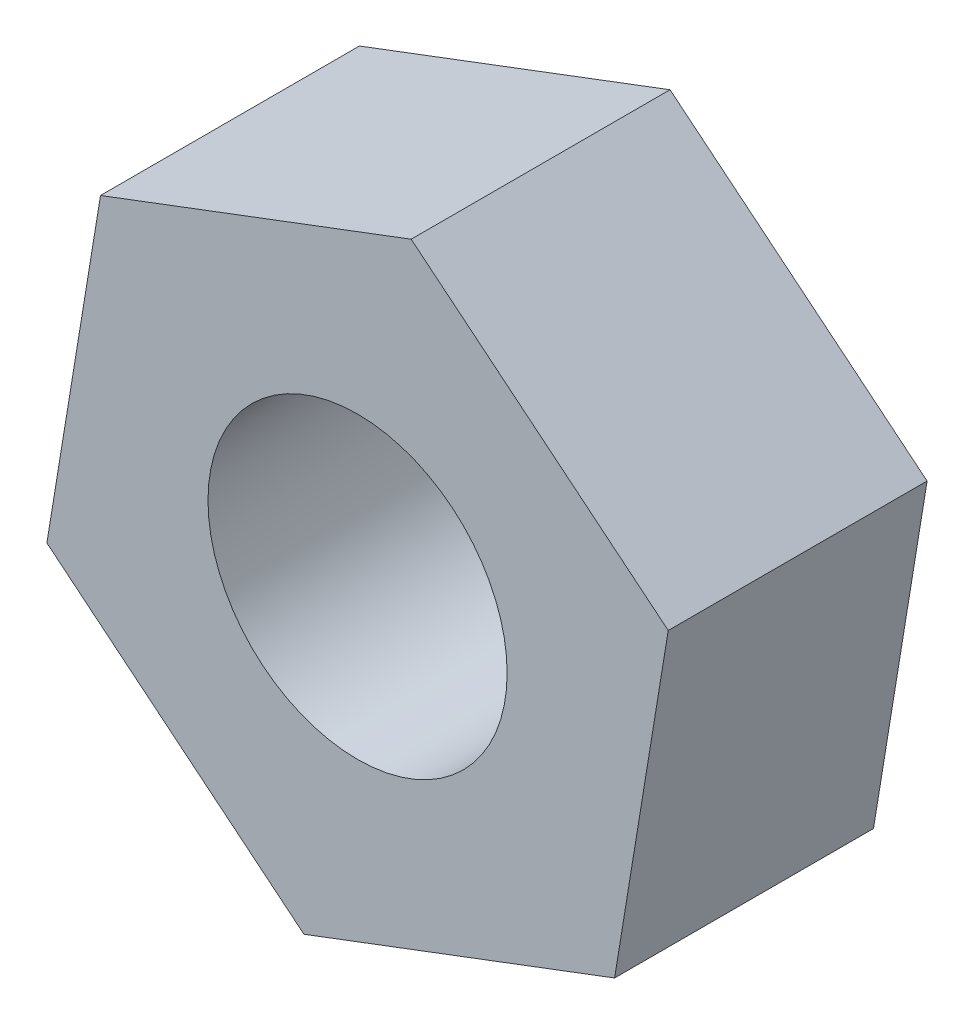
ISO-10303-21;
HEADER;
FILE_DESCRIPTION(('STEP AP214'),'2;1');
FILE_NAME('part.step','',(''),(''),'','','');
FILE_SCHEMA(('AUTOMOTIVE_DESIGN { 1 0 10303 214 1 1 1 1 }'));
ENDSEC;
DATA;
#1=APPLICATION_CONTEXT('core data for automotive mechanical design processes');
#2=APPLICATION_PROTOCOL_DEFINITION('international standard','automotive_design',2000,#1);
#3=PRODUCT_CONTEXT('',#1,'mechanical');
#4=PRODUCT('Part','Part','',(#3));
#5=PRODUCT_RELATED_PRODUCT_CATEGORY('part','',(#4));
#6=PRODUCT_DEFINITION_FORMATION('','',#4);
#7=PRODUCT_DEFINITION_CONTEXT('part definition',#1,'design');
#8=PRODUCT_DEFINITION('design','',#6,#7);
#9=PRODUCT_DEFINITION_SHAPE('','',#8);
#10=(LENGTH_UNIT() NAMED_UNIT(*) SI_UNIT(.MILLI.,.METRE.));
#11=(NAMED_UNIT(*) PLANE_ANGLE_UNIT() SI_UNIT($,.RADIAN.));
#12=(NAMED_UNIT(*) SI_UNIT($,.STERADIAN.) SOLID_ANGLE_UNIT());
#13=UNCERTAINTY_MEASURE_WITH_UNIT(LENGTH_MEASURE(1.E-05),#10,'distance_accuracy_value','');
#14=(GEOMETRIC_REPRESENTATION_CONTEXT(3) GLOBAL_UNCERTAINTY_ASSIGNED_CONTEXT((#13)) GLOBAL_UNIT_ASSIGNED_CONTEXT((#10,
#11,#12)) REPRESENTATION_CONTEXT('',''));
#15=CARTESIAN_POINT('',(0.,0.,0.));
#16=DIRECTION('',(0.,0.,1.));
#17=DIRECTION('',(1.,0.,0.));
#18=AXIS2_PLACEMENT_3D('',#15,#16,#17);
#19=CARTESIAN_POINT('',(-0.931966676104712,-5.69778653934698,4.5));
#20=DIRECTION('',(-0.353647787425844,0.93537866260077,0.));
#21=DIRECTION('',(-0.93537866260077,-0.353647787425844,0.));
#22=AXIS2_PLACEMENT_3D('',#19,#20,#21);
#23=PLANE('',#22);
#24=DIRECTION('',(0.93537866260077,0.353647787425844,0.));
#25=VECTOR('',#24,1.);
#26=CARTESIAN_POINT('',(-0.931966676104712,-5.69778653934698,0.));
#27=LINE('',#26,#25);
#28=CARTESIAN_POINT('',(-0.931966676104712,-5.69778653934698,0.));
#29=VERTEX_POINT('',#28);
#30=CARTESIAN_POINT('',(4.46844455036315,-3.65600008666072,0.));
#31=VERTEX_POINT('',#30);
#32=EDGE_CURVE('E118',#29,#31,#27,.T.);
#33=ORIENTED_EDGE('',*,*,#32,.T.);
#34=DIRECTION('',(0.,0.,-1.));
#35=VECTOR('',#34,1.);
#36=CARTESIAN_POINT('',(4.46844455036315,-3.65600008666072,4.5));
#37=LINE('',#36,#35);
#38=CARTESIAN_POINT('',(4.46844455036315,-3.65600008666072,4.5));
#39=VERTEX_POINT('',#38);
#40=EDGE_CURVE('E11',#39,#31,#37,.T.);
#41=ORIENTED_EDGE('',*,*,#40,.F.);
#42=DIRECTION('',(0.93537866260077,0.353647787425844,0.));
#43=VECTOR('',#42,1.);
#44=CARTESIAN_POINT('',(-0.931966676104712,-5.69778653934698,4.5));
#45=LINE('',#44,#43);
#46=CARTESIAN_POINT('',(-0.931966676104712,-5.69778653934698,4.5));
#47=VERTEX_POINT('',#46);
#48=EDGE_CURVE('E129',#47,#39,#45,.T.);
#49=ORIENTED_EDGE('',*,*,#48,.F.);
#50=DIRECTION('',(0.,0.,-1.));
#51=VECTOR('',#50,1.);
#52=CARTESIAN_POINT('',(-0.931966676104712,-5.69778653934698,4.5));
#53=LINE('',#52,#51);
#54=EDGE_CURVE('E114',#47,#29,#53,.T.);
#55=ORIENTED_EDGE('',*,*,#54,.T.);
#56=EDGE_LOOP('',(#33,#41,#49,#55));
#57=FACE_BOUND('',#56,.T.);
#58=ADVANCED_FACE('F34',(#57),#23,.F.);
#59=CARTESIAN_POINT('',(4.46844455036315,-3.65600008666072,4.5));
#60=DIRECTION('',(-0.986885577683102,0.161421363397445,0.));
#61=DIRECTION('',(-0.161421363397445,-0.986885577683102,0.));
#62=AXIS2_PLACEMENT_3D('',#59,#60,#61);
#63=PLANE('',#62);
#64=DIRECTION('',(0.161421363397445,0.986885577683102,0.));
#65=VECTOR('',#64,1.);
#66=CARTESIAN_POINT('',(4.46844455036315,-3.65600008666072,0.));
#67=LINE('',#66,#65);
#68=CARTESIAN_POINT('',(5.40041122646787,2.04178645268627,0.));
#69=VERTEX_POINT('',#68);
#70=EDGE_CURVE('E121',#31,#69,#67,.T.);
#71=ORIENTED_EDGE('',*,*,#70,.T.);
#72=DIRECTION('',(0.,0.,-1.));
#73=VECTOR('',#72,1.);
#74=CARTESIAN_POINT('',(5.40041122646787,2.04178645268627,4.5));
#75=LINE('',#74,#73);
#76=CARTESIAN_POINT('',(5.40041122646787,2.04178645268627,4.5));
#77=VERTEX_POINT('',#76);
#78=EDGE_CURVE('E42',#77,#69,#75,.T.);
#79=ORIENTED_EDGE('',*,*,#78,.F.);
#80=DIRECTION('',(0.161421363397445,0.986885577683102,0.));
#81=VECTOR('',#80,1.);
#82=CARTESIAN_POINT('',(4.46844455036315,-3.65600008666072,4.5));
#83=LINE('',#82,#81);
#84=EDGE_CURVE('E87',#39,#77,#83,.T.);
#85=ORIENTED_EDGE('',*,*,#84,.F.);
#86=ORIENTED_EDGE('',*,*,#40,.T.);
#87=EDGE_LOOP('',(#71,#79,#85,#86));
#88=FACE_BOUND('',#87,.T.);
#89=ADVANCED_FACE('F154',(#88),#63,.F.);
#90=CARTESIAN_POINT('',(5.40041122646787,2.04178645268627,4.5));
#91=DIRECTION('',(-0.633237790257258,-0.773957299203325,0.));
#92=DIRECTION('',(0.773957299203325,-0.633237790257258,0.));
#93=AXIS2_PLACEMENT_3D('',#90,#91,#92);
#94=PLANE('',#93);
#95=DIRECTION('',(-0.773957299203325,0.633237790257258,0.));
#96=VECTOR('',#95,1.);
#97=CARTESIAN_POINT('',(5.40041122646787,2.04178645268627,0.));
#98=LINE('',#97,#96);
#99=CARTESIAN_POINT('',(0.931966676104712,5.69778653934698,0.));
#100=VERTEX_POINT('',#99);
#101=EDGE_CURVE('E124',#69,#100,#98,.T.);
#102=ORIENTED_EDGE('',*,*,#101,.T.);
#103=DIRECTION('',(0.,0.,-1.));
#104=VECTOR('',#103,1.);
#105=CARTESIAN_POINT('',(0.931966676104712,5.69778653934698,4.5));
#106=LINE('',#105,#104);
#107=CARTESIAN_POINT('',(0.931966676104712,5.69778653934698,4.5));
#108=VERTEX_POINT('',#107);
#109=EDGE_CURVE('E109',#108,#100,#106,.T.);
#110=ORIENTED_EDGE('',*,*,#109,.F.);
#111=DIRECTION('',(-0.773957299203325,0.633237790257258,0.));
#112=VECTOR('',#111,1.);
#113=CARTESIAN_POINT('',(5.40041122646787,2.04178645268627,4.5));
#114=LINE('',#113,#112);
#115=EDGE_CURVE('E100',#77,#108,#114,.T.);
#116=ORIENTED_EDGE('',*,*,#115,.F.);
#117=ORIENTED_EDGE('',*,*,#78,.T.);
#118=EDGE_LOOP('',(#102,#110,#116,#117));
#119=FACE_BOUND('',#118,.T.);
#120=ADVANCED_FACE('F135',(#119),#94,.F.);
#121=CARTESIAN_POINT('',(0.931966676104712,5.69778653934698,4.5));
#122=DIRECTION('',(0.353647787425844,-0.93537866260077,0.));
#123=DIRECTION('',(0.93537866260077,0.353647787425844,0.));
#124=AXIS2_PLACEMENT_3D('',#121,#122,#123);
#125=PLANE('',#124);
#126=DIRECTION('',(-0.93537866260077,-0.353647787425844,0.));
#127=VECTOR('',#126,1.);
#128=CARTESIAN_POINT('',(0.931966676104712,5.69778653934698,0.));
#129=LINE('',#128,#127);
#130=CARTESIAN_POINT('',(-4.46844455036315,3.65600008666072,0.));
#131=VERTEX_POINT('',#130);
#132=EDGE_CURVE('E108',#100,#131,#129,.T.);
#133=ORIENTED_EDGE('',*,*,#132,.T.);
#134=DIRECTION('',(0.,0.,-1.));
#135=VECTOR('',#134,1.);
#136=CARTESIAN_POINT('',(-4.46844455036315,3.65600008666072,4.5));
#137=LINE('',#136,#135);
#138=CARTESIAN_POINT('',(-4.46844455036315,3.65600008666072,4.5));
#139=VERTEX_POINT('',#138);
#140=EDGE_CURVE('E105',#139,#131,#137,.T.);
#141=ORIENTED_EDGE('',*,*,#140,.F.);
#142=DIRECTION('',(-0.93537866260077,-0.353647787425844,0.));
#143=VECTOR('',#142,1.);
#144=CARTESIAN_POINT('',(0.931966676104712,5.69778653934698,4.5));
#145=LINE('',#144,#143);
#146=EDGE_CURVE('E94',#108,#139,#145,.T.);
#147=ORIENTED_EDGE('',*,*,#146,.F.);
#148=ORIENTED_EDGE('',*,*,#109,.T.);
#149=EDGE_LOOP('',(#133,#141,#147,#148));
#150=FACE_BOUND('',#149,.T.);
#151=ADVANCED_FACE('F106',(#150),#125,.F.);
#152=CARTESIAN_POINT('',(-4.46844455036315,3.65600008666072,4.5));
#153=DIRECTION('',(0.986885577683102,-0.161421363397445,0.));
#154=DIRECTION('',(0.161421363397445,0.986885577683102,0.));
#155=AXIS2_PLACEMENT_3D('',#152,#153,#154);
#156=PLANE('',#155);
#157=DIRECTION('',(-0.161421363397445,-0.986885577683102,0.));
#158=VECTOR('',#157,1.);
#159=CARTESIAN_POINT('',(-4.46844455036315,3.65600008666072,0.));
#160=LINE('',#159,#158);
#161=CARTESIAN_POINT('',(-5.40041122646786,-2.04178645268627,0.));
#162=VERTEX_POINT('',#161);
#163=EDGE_CURVE('E73',#131,#162,#160,.T.);
#164=ORIENTED_EDGE('',*,*,#163,.T.);
#165=DIRECTION('',(0.,0.,-1.));
#166=VECTOR('',#165,1.);
#167=CARTESIAN_POINT('',(-5.40041122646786,-2.04178645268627,4.5));
#168=LINE('',#167,#166);
#169=CARTESIAN_POINT('',(-5.40041122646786,-2.04178645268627,4.5));
#170=VERTEX_POINT('',#169);
#171=EDGE_CURVE('E110',#170,#162,#168,.T.);
#172=ORIENTED_EDGE('',*,*,#171,.F.);
#173=DIRECTION('',(-0.161421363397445,-0.986885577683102,0.));
#174=VECTOR('',#173,1.);
#175=CARTESIAN_POINT('',(-4.46844455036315,3.65600008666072,4.5));
#176=LINE('',#175,#174);
#177=EDGE_CURVE('E98',#139,#170,#176,.T.);
#178=ORIENTED_EDGE('',*,*,#177,.F.);
#179=ORIENTED_EDGE('',*,*,#140,.T.);
#180=EDGE_LOOP('',(#164,#172,#178,#179));
#181=FACE_BOUND('',#180,.T.);
#182=ADVANCED_FACE('F112',(#181),#156,.F.);
#183=CARTESIAN_POINT('',(-5.40041122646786,-2.04178645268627,4.5));
#184=DIRECTION('',(0.633237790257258,0.773957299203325,0.));
#185=DIRECTION('',(-0.773957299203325,0.633237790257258,0.));
#186=AXIS2_PLACEMENT_3D('',#183,#184,#185);
#187=PLANE('',#186);
#188=DIRECTION('',(0.773957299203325,-0.633237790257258,0.));
#189=VECTOR('',#188,1.);
#190=CARTESIAN_POINT('',(-5.40041122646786,-2.04178645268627,0.));
#191=LINE('',#190,#189);
#192=EDGE_CURVE('E79',#162,#29,#191,.T.);
#193=ORIENTED_EDGE('',*,*,#192,.T.);
#194=ORIENTED_EDGE('',*,*,#54,.F.);
#195=DIRECTION('',(0.773957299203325,-0.633237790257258,0.));
#196=VECTOR('',#195,1.);
#197=CARTESIAN_POINT('',(-5.40041122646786,-2.04178645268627,4.5));
#198=LINE('',#197,#196);
#199=EDGE_CURVE('E50',#170,#47,#198,.T.);
#200=ORIENTED_EDGE('',*,*,#199,.F.);
#201=ORIENTED_EDGE('',*,*,#171,.T.);
#202=EDGE_LOOP('',(#193,#194,#200,#201));
#203=FACE_BOUND('',#202,.T.);
#204=ADVANCED_FACE('F142',(#203),#187,.F.);
#205=CARTESIAN_POINT('',(4.46844455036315,-3.65600008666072,4.5));
#206=DIRECTION('',(0.,0.,1.));
#207=DIRECTION('',(1.,0.,0.));
#208=AXIS2_PLACEMENT_3D('',#205,#206,#207);
#209=PLANE('',#208);
#210=CARTESIAN_POINT('',(0.,0.,4.5));
#211=DIRECTION('',(0.,0.,1.));
#212=DIRECTION('',(1.,0.,0.));
#213=AXIS2_PLACEMENT_3D('',#210,#211,#212);
#214=CIRCLE('',#213,2.59999999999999);
#215=CARTESIAN_POINT('',(2.59999999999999,0.,4.5));
#216=VERTEX_POINT('',#215);
#217=EDGE_CURVE('E122',#216,#216,#214,.T.);
#218=ORIENTED_EDGE('',*,*,#217,.F.);
#219=EDGE_LOOP('',(#218));
#220=FACE_BOUND('',#219,.T.);
#221=ORIENTED_EDGE('',*,*,#48,.T.);
#222=ORIENTED_EDGE('',*,*,#84,.T.);
#223=ORIENTED_EDGE('',*,*,#115,.T.);
#224=ORIENTED_EDGE('',*,*,#146,.T.);
#225=ORIENTED_EDGE('',*,*,#177,.T.);
#226=ORIENTED_EDGE('',*,*,#199,.T.);
#227=EDGE_LOOP('',(#221,#222,#223,#224,#225,#226));
#228=FACE_BOUND('',#227,.T.);
#229=ADVANCED_FACE('F96',(#220,#228),#209,.T.);
#230=CARTESIAN_POINT('',(4.46844455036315,-3.65600008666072,0.));
#231=DIRECTION('',(0.,0.,1.));
#232=DIRECTION('',(1.,0.,0.));
#233=AXIS2_PLACEMENT_3D('',#230,#231,#232);
#234=PLANE('',#233);
#235=CARTESIAN_POINT('',(0.,0.,0.));
#236=DIRECTION('',(0.,0.,-1.));
#237=DIRECTION('',(-1.,0.,0.));
#238=AXIS2_PLACEMENT_3D('',#235,#236,#237);
#239=CIRCLE('',#238,2.59999999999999);
#240=CARTESIAN_POINT('',(-2.59999999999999,0.,0.));
#241=VERTEX_POINT('',#240);
#242=EDGE_CURVE('E211',#241,#241,#239,.T.);
#243=ORIENTED_EDGE('',*,*,#242,.F.);
#244=EDGE_LOOP('',(#243));
#245=FACE_BOUND('',#244,.T.);
#246=ORIENTED_EDGE('',*,*,#32,.F.);
#247=ORIENTED_EDGE('',*,*,#192,.F.);
#248=ORIENTED_EDGE('',*,*,#163,.F.);
#249=ORIENTED_EDGE('',*,*,#132,.F.);
#250=ORIENTED_EDGE('',*,*,#101,.F.);
#251=ORIENTED_EDGE('',*,*,#70,.F.);
#252=EDGE_LOOP('',(#246,#247,#248,#249,#250,#251));
#253=FACE_BOUND('',#252,.T.);
#254=ADVANCED_FACE('F138',(#245,#253),#234,.F.);
#255=CARTESIAN_POINT('',(0.,0.,0.));
#256=DIRECTION('',(0.,0.,-1.));
#257=DIRECTION('',(-1.,0.,0.));
#258=AXIS2_PLACEMENT_3D('',#255,#256,#257);
#259=CYLINDRICAL_SURFACE('',#258,2.59999999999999);
#260=ORIENTED_EDGE('',*,*,#217,.T.);
#261=EDGE_LOOP('',(#260));
#262=FACE_BOUND('',#261,.T.);
#263=ORIENTED_EDGE('',*,*,#242,.T.);
#264=EDGE_LOOP('',(#263));
#265=FACE_BOUND('',#264,.T.);
#266=ADVANCED_FACE('F191',(#262,#265),#259,.F.);
#267=CLOSED_SHELL('',(#58,#89,#120,#151,#182,#204,#229,#254,#266));
#268=MANIFOLD_SOLID_BREP('B2',#267);
#269=ADVANCED_BREP_SHAPE_REPRESENTATION('',(#18,#268),#14);
#270=SHAPE_DEFINITION_REPRESENTATION(#9,#269);
ENDSEC;
END-ISO-10303-21;
